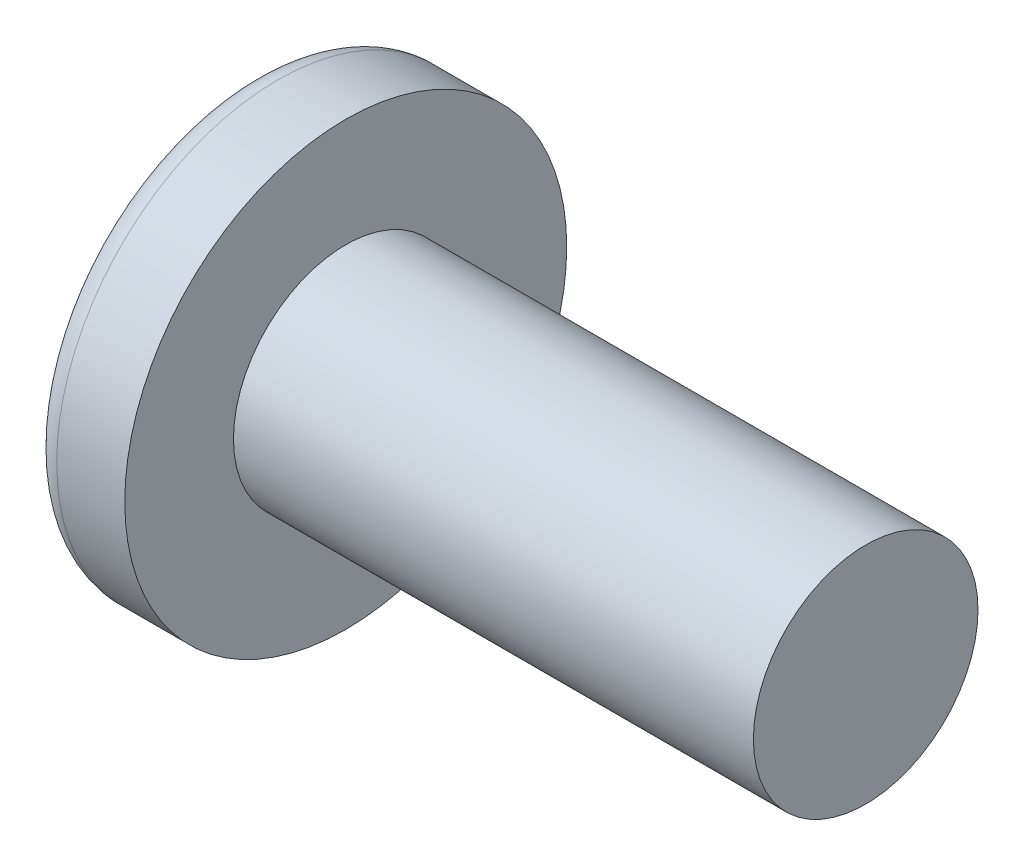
from build123d import *

# Parameters (mm, degrees)
CIRPATTERN1_COUNT = 2
CIRPATTERN1_ANGLE = 90


with BuildPart() as part:
    # BodySke → Base-Revolve (revolve)
    with BuildSketch(Plane.XY, mode=Mode.PRIVATE) as base_revolve_sk:
        with BuildLine():
            Line((3.8354, 2.7432), (3.8354, 5.3975))
            Line((3.8354, 5.3975), (2.172867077, 5.3975))
            ThreePointArc((2.172867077, 5.3975), (1.883555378, 5.32776431), (1.657788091, 5.133873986))
            ThreePointArc((1.657788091, 5.133873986), (0.424721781, 2.697448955), (0, 0))
            Line((0, 0), (16.5354, 0))
            Line((16.5354, 0), (16.5354, 2.7432))
            Line((16.5354, 2.7432), (3.8354, 2.7432))
        make_face()
    revolve(base_revolve_sk.sketch.rotate(Axis((-25.4, 0, 0), (1, 0, 0)), 90), axis=Axis((-25.4, 0, 0), (1, 0, 0)))

    # Sketch3 → Cut-Loft1 section 0
    with BuildSketch(Plane(origin=(0, 0, 0), x_dir=(0, 0, -1), z_dir=(1, 0, 0))):
        with BuildLine():
            Line((0.6477, -3.4544), (-0.6477, -3.4544))
            Line((-0.6477, -3.4544), (-0.6477, 3.4544))
            Line((-0.6477, 3.4544), (0.6477, 3.4544))
            Line((0.6477, 3.4544), (0.6477, -3.4544))
        make_face()
    # Sketch4 → Cut-Loft1 section 1
    with BuildSketch(Plane(origin=(4.0132, 0, 0), x_dir=(0, 0, -1), z_dir=(1, 0, 0))):
        with BuildLine():
            Line((0.32385, -0.32385), (-0.32385, -0.32385))
            Line((-0.32385, -0.32385), (-0.32385, 0.32385))
            Line((-0.32385, 0.32385), (0.32385, 0.32385))
            Line((0.32385, 0.32385), (0.32385, -0.32385))
        make_face()
    cut_loft1 = loft(mode=Mode.SUBTRACT)

    # CirPattern1: Cut-Loft1 ×2 about axis
    cirpattern1_axis = Axis((0, 0, 0), (1, 0, 0))
    for i in range(1, CIRPATTERN1_COUNT):
        add(cut_loft1.rotate(cirpattern1_axis, i * CIRPATTERN1_ANGLE / (CIRPATTERN1_COUNT - 1)), mode=Mode.SUBTRACT)


solid = part.part
